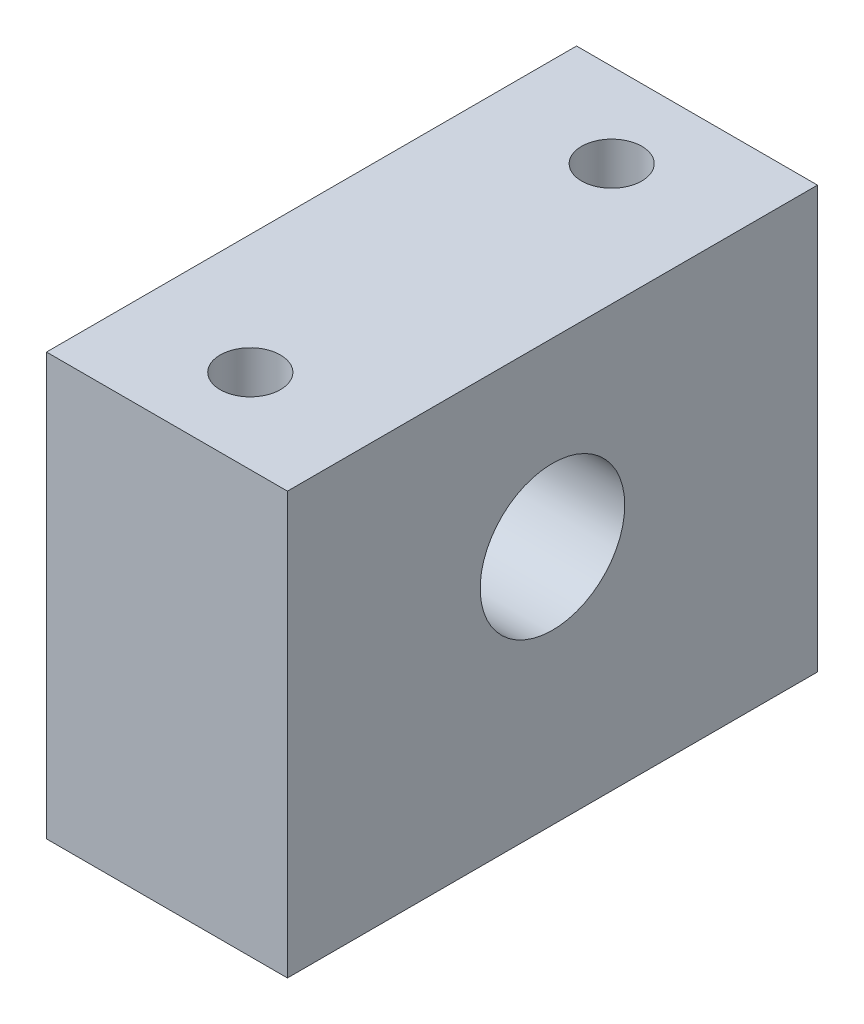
ISO-10303-21;
HEADER;
FILE_DESCRIPTION(('STEP AP214'),'2;1');
FILE_NAME('part.step','',(''),(''),'','','');
FILE_SCHEMA(('AUTOMOTIVE_DESIGN { 1 0 10303 214 1 1 1 1 }'));
ENDSEC;
DATA;
#1=APPLICATION_CONTEXT('core data for automotive mechanical design processes');
#2=APPLICATION_PROTOCOL_DEFINITION('international standard','automotive_design',2000,#1);
#3=PRODUCT_CONTEXT('',#1,'mechanical');
#4=PRODUCT('Part','Part','',(#3));
#5=PRODUCT_RELATED_PRODUCT_CATEGORY('part','',(#4));
#6=PRODUCT_DEFINITION_FORMATION('','',#4);
#7=PRODUCT_DEFINITION_CONTEXT('part definition',#1,'design');
#8=PRODUCT_DEFINITION('design','',#6,#7);
#9=PRODUCT_DEFINITION_SHAPE('','',#8);
#10=(LENGTH_UNIT() NAMED_UNIT(*) SI_UNIT(.MILLI.,.METRE.));
#11=(NAMED_UNIT(*) PLANE_ANGLE_UNIT() SI_UNIT($,.RADIAN.));
#12=(NAMED_UNIT(*) SI_UNIT($,.STERADIAN.) SOLID_ANGLE_UNIT());
#13=UNCERTAINTY_MEASURE_WITH_UNIT(LENGTH_MEASURE(1.E-05),#10,'distance_accuracy_value','');
#14=(GEOMETRIC_REPRESENTATION_CONTEXT(3) GLOBAL_UNCERTAINTY_ASSIGNED_CONTEXT((#13)) GLOBAL_UNIT_ASSIGNED_CONTEXT((#10,
#11,#12)) REPRESENTATION_CONTEXT('',''));
#15=CARTESIAN_POINT('',(0.,0.,0.));
#16=DIRECTION('',(0.,0.,1.));
#17=DIRECTION('',(1.,0.,0.));
#18=AXIS2_PLACEMENT_3D('',#15,#16,#17);
#19=CARTESIAN_POINT('',(-39.472022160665,-3.5749307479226,43.9999999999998));
#20=DIRECTION('',(1.,0.,0.));
#21=DIRECTION('',(0.,1.,0.));
#22=AXIS2_PLACEMENT_3D('',#19,#20,#21);
#23=PLANE('',#22);
#24=CARTESIAN_POINT('',(-39.4720221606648,-18.5749307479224,22.));
#25=DIRECTION('',(1.,0.,0.));
#26=DIRECTION('',(0.,1.,0.));
#27=AXIS2_PLACEMENT_3D('',#24,#25,#26);
#28=CIRCLE('',#27,6.);
#29=CARTESIAN_POINT('',(-39.4720221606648,-12.5749307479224,22.));
#30=VERTEX_POINT('',#29);
#31=EDGE_CURVE('E95',#30,#30,#28,.T.);
#32=ORIENTED_EDGE('',*,*,#31,.T.);
#33=EDGE_LOOP('',(#32));
#34=FACE_BOUND('',#33,.T.);
#35=DIRECTION('',(0.,-1.,0.));
#36=VECTOR('',#35,1.);
#37=CARTESIAN_POINT('',(-39.4720221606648,-3.57493074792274,0.));
#38=LINE('',#37,#36);
#39=CARTESIAN_POINT('',(-39.4720221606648,-3.57493074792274,0.));
#40=VERTEX_POINT('',#39);
#41=CARTESIAN_POINT('',(-39.4720221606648,-38.5749307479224,0.));
#42=VERTEX_POINT('',#41);
#43=EDGE_CURVE('E82',#40,#42,#38,.T.);
#44=ORIENTED_EDGE('',*,*,#43,.T.);
#45=DIRECTION('',(0.,0.,-1.));
#46=VECTOR('',#45,1.);
#47=CARTESIAN_POINT('',(-39.4720221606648,-38.5749307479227,44.));
#48=LINE('',#47,#46);
#49=CARTESIAN_POINT('',(-39.4720221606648,-38.5749307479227,44.));
#50=VERTEX_POINT('',#49);
#51=EDGE_CURVE('E13',#50,#42,#48,.T.);
#52=ORIENTED_EDGE('',*,*,#51,.F.);
#53=DIRECTION('',(0.,-1.,0.));
#54=VECTOR('',#53,1.);
#55=CARTESIAN_POINT('',(-39.472022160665,-3.5749307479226,43.9999999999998));
#56=LINE('',#55,#54);
#57=CARTESIAN_POINT('',(-39.472022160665,-3.5749307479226,43.9999999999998));
#58=VERTEX_POINT('',#57);
#59=EDGE_CURVE('E105',#58,#50,#56,.T.);
#60=ORIENTED_EDGE('',*,*,#59,.F.);
#61=DIRECTION('',(0.,0.,-1.));
#62=VECTOR('',#61,1.);
#63=CARTESIAN_POINT('',(-39.472022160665,-3.5749307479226,43.9999999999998));
#64=LINE('',#63,#62);
#65=EDGE_CURVE('E94',#58,#40,#64,.T.);
#66=ORIENTED_EDGE('',*,*,#65,.T.);
#67=EDGE_LOOP('',(#44,#52,#60,#66));
#68=FACE_BOUND('',#67,.T.);
#69=ADVANCED_FACE('F38',(#34,#68),#23,.F.);
#70=CARTESIAN_POINT('',(-39.4720221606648,-38.5749307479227,44.));
#71=DIRECTION('',(0.,1.,0.));
#72=DIRECTION('',(0.,0.,1.));
#73=AXIS2_PLACEMENT_3D('',#70,#71,#72);
#74=PLANE('',#73);
#75=CARTESIAN_POINT('',(-29.5557462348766,-38.5749307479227,37.));
#76=DIRECTION('',(0.,-1.,0.));
#77=DIRECTION('',(0.,0.,-1.));
#78=AXIS2_PLACEMENT_3D('',#75,#76,#77);
#79=CIRCLE('',#78,2.49999999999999);
#80=CARTESIAN_POINT('',(-29.5557462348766,-38.5749307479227,34.5000000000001));
#81=VERTEX_POINT('',#80);
#82=EDGE_CURVE('E159',#81,#81,#79,.T.);
#83=ORIENTED_EDGE('',*,*,#82,.F.);
#84=EDGE_LOOP('',(#83));
#85=FACE_BOUND('',#84,.T.);
#86=CARTESIAN_POINT('',(-29.5557462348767,-38.5749307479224,6.9999999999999));
#87=DIRECTION('',(0.,-1.,0.));
#88=DIRECTION('',(0.,0.,-1.));
#89=AXIS2_PLACEMENT_3D('',#86,#87,#88);
#90=CIRCLE('',#89,2.49999999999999);
#91=CARTESIAN_POINT('',(-29.5557462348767,-38.5749307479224,4.49999999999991));
#92=VERTEX_POINT('',#91);
#93=EDGE_CURVE('E163',#92,#92,#90,.T.);
#94=ORIENTED_EDGE('',*,*,#93,.F.);
#95=EDGE_LOOP('',(#94));
#96=FACE_BOUND('',#95,.T.);
#97=DIRECTION('',(1.,0.,0.));
#98=VECTOR('',#97,1.);
#99=CARTESIAN_POINT('',(-39.4720221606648,-38.5749307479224,0.));
#100=LINE('',#99,#98);
#101=CARTESIAN_POINT('',(-19.4720221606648,-38.5749307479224,0.));
#102=VERTEX_POINT('',#101);
#103=EDGE_CURVE('E78',#42,#102,#100,.T.);
#104=ORIENTED_EDGE('',*,*,#103,.T.);
#105=DIRECTION('',(0.,0.,-1.));
#106=VECTOR('',#105,1.);
#107=CARTESIAN_POINT('',(-19.4720221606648,-38.5749307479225,43.9999999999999));
#108=LINE('',#107,#106);
#109=CARTESIAN_POINT('',(-19.4720221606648,-38.5749307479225,43.9999999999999));
#110=VERTEX_POINT('',#109);
#111=EDGE_CURVE('E45',#110,#102,#108,.T.);
#112=ORIENTED_EDGE('',*,*,#111,.F.);
#113=DIRECTION('',(1.,0.,0.));
#114=VECTOR('',#113,1.);
#115=CARTESIAN_POINT('',(-39.4720221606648,-38.5749307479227,44.));
#116=LINE('',#115,#114);
#117=EDGE_CURVE('E90',#50,#110,#116,.T.);
#118=ORIENTED_EDGE('',*,*,#117,.F.);
#119=ORIENTED_EDGE('',*,*,#51,.T.);
#120=EDGE_LOOP('',(#104,#112,#118,#119));
#121=FACE_BOUND('',#120,.T.);
#122=ADVANCED_FACE('F89',(#85,#96,#121),#74,.F.);
#123=CARTESIAN_POINT('',(-19.4720221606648,-3.57493074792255,43.9999999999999));
#124=DIRECTION('',(-1.,0.,0.));
#125=DIRECTION('',(0.,0.,1.));
#126=AXIS2_PLACEMENT_3D('',#123,#124,#125);
#127=PLANE('',#126);
#128=CARTESIAN_POINT('',(-19.4720221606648,-18.5749307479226,21.9999999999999));
#129=DIRECTION('',(1.,0.,0.));
#130=DIRECTION('',(0.,0.,-1.));
#131=AXIS2_PLACEMENT_3D('',#128,#129,#130);
#132=CIRCLE('',#131,6.);
#133=CARTESIAN_POINT('',(-19.4720221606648,-18.5749307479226,15.9999999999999));
#134=VERTEX_POINT('',#133);
#135=EDGE_CURVE('E98',#134,#134,#132,.T.);
#136=ORIENTED_EDGE('',*,*,#135,.F.);
#137=EDGE_LOOP('',(#136));
#138=FACE_BOUND('',#137,.T.);
#139=DIRECTION('',(0.,1.,0.));
#140=VECTOR('',#139,1.);
#141=CARTESIAN_POINT('',(-19.4720221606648,-3.57493074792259,-1.11022302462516E-13));
#142=LINE('',#141,#140);
#143=CARTESIAN_POINT('',(-19.4720221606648,-3.57493074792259,-1.11022302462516E-13));
#144=VERTEX_POINT('',#143);
#145=EDGE_CURVE('E83',#102,#144,#142,.T.);
#146=ORIENTED_EDGE('',*,*,#145,.T.);
#147=DIRECTION('',(0.,0.,-1.));
#148=VECTOR('',#147,1.);
#149=CARTESIAN_POINT('',(-19.4720221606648,-3.57493074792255,43.9999999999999));
#150=LINE('',#149,#148);
#151=CARTESIAN_POINT('',(-19.4720221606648,-3.57493074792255,43.9999999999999));
#152=VERTEX_POINT('',#151);
#153=EDGE_CURVE('E111',#152,#144,#150,.T.);
#154=ORIENTED_EDGE('',*,*,#153,.F.);
#155=DIRECTION('',(0.,1.,0.));
#156=VECTOR('',#155,1.);
#157=CARTESIAN_POINT('',(-19.4720221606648,-3.57493074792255,43.9999999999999));
#158=LINE('',#157,#156);
#159=EDGE_CURVE('E57',#110,#152,#158,.T.);
#160=ORIENTED_EDGE('',*,*,#159,.F.);
#161=ORIENTED_EDGE('',*,*,#111,.T.);
#162=EDGE_LOOP('',(#146,#154,#160,#161));
#163=FACE_BOUND('',#162,.T.);
#164=ADVANCED_FACE('F114',(#138,#163),#127,.F.);
#165=CARTESIAN_POINT('',(-39.472022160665,-3.5749307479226,43.9999999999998));
#166=DIRECTION('',(0.,-1.,0.));
#167=DIRECTION('',(0.,0.,-1.));
#168=AXIS2_PLACEMENT_3D('',#165,#166,#167);
#169=PLANE('',#168);
#170=CARTESIAN_POINT('',(-29.5557462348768,-3.57493074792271,37.0000000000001));
#171=DIRECTION('',(0.,-1.,0.));
#172=DIRECTION('',(0.,0.,-1.));
#173=AXIS2_PLACEMENT_3D('',#170,#171,#172);
#174=CIRCLE('',#173,2.49999999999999);
#175=CARTESIAN_POINT('',(-29.5557462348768,-3.57493074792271,34.5000000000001));
#176=VERTEX_POINT('',#175);
#177=EDGE_CURVE('E156',#176,#176,#174,.T.);
#178=ORIENTED_EDGE('',*,*,#177,.T.);
#179=EDGE_LOOP('',(#178));
#180=FACE_BOUND('',#179,.T.);
#181=CARTESIAN_POINT('',(-29.5557462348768,-3.57493074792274,7.00000000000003));
#182=DIRECTION('',(0.,-1.,0.));
#183=DIRECTION('',(0.,0.,-1.));
#184=AXIS2_PLACEMENT_3D('',#181,#182,#183);
#185=CIRCLE('',#184,2.49999999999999);
#186=CARTESIAN_POINT('',(-29.5557462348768,-3.57493074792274,4.50000000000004));
#187=VERTEX_POINT('',#186);
#188=EDGE_CURVE('E160',#187,#187,#185,.T.);
#189=ORIENTED_EDGE('',*,*,#188,.T.);
#190=EDGE_LOOP('',(#189));
#191=FACE_BOUND('',#190,.T.);
#192=DIRECTION('',(-1.,0.,0.));
#193=VECTOR('',#192,1.);
#194=CARTESIAN_POINT('',(-39.4720221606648,-3.57493074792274,0.));
#195=LINE('',#194,#193);
#196=EDGE_CURVE('E103',#144,#40,#195,.T.);
#197=ORIENTED_EDGE('',*,*,#196,.T.);
#198=ORIENTED_EDGE('',*,*,#65,.F.);
#199=DIRECTION('',(-1.,0.,0.));
#200=VECTOR('',#199,1.);
#201=CARTESIAN_POINT('',(-39.472022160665,-3.5749307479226,43.9999999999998));
#202=LINE('',#201,#200);
#203=EDGE_CURVE('E52',#152,#58,#202,.T.);
#204=ORIENTED_EDGE('',*,*,#203,.F.);
#205=ORIENTED_EDGE('',*,*,#153,.T.);
#206=EDGE_LOOP('',(#197,#198,#204,#205));
#207=FACE_BOUND('',#206,.T.);
#208=ADVANCED_FACE('F116',(#180,#191,#207),#169,.F.);
#209=CARTESIAN_POINT('',(-39.4720221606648,-38.5749307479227,44.));
#210=DIRECTION('',(0.,0.,1.));
#211=DIRECTION('',(1.,0.,0.));
#212=AXIS2_PLACEMENT_3D('',#209,#210,#211);
#213=PLANE('',#212);
#214=ORIENTED_EDGE('',*,*,#59,.T.);
#215=ORIENTED_EDGE('',*,*,#117,.T.);
#216=ORIENTED_EDGE('',*,*,#159,.T.);
#217=ORIENTED_EDGE('',*,*,#203,.T.);
#218=EDGE_LOOP('',(#214,#215,#216,#217));
#219=FACE_BOUND('',#218,.T.);
#220=ADVANCED_FACE('F117',(#219),#213,.T.);
#221=CARTESIAN_POINT('',(-39.4720221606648,-38.5749307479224,0.));
#222=DIRECTION('',(0.,0.,1.));
#223=DIRECTION('',(1.,0.,0.));
#224=AXIS2_PLACEMENT_3D('',#221,#222,#223);
#225=PLANE('',#224);
#226=ORIENTED_EDGE('',*,*,#43,.F.);
#227=ORIENTED_EDGE('',*,*,#196,.F.);
#228=ORIENTED_EDGE('',*,*,#145,.F.);
#229=ORIENTED_EDGE('',*,*,#103,.F.);
#230=EDGE_LOOP('',(#226,#227,#228,#229));
#231=FACE_BOUND('',#230,.T.);
#232=ADVANCED_FACE('F79',(#231),#225,.F.);
#233=CARTESIAN_POINT('',(-63.4720221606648,-18.5749307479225,22.));
#234=DIRECTION('',(1.,0.,0.));
#235=DIRECTION('',(0.,0.,-1.));
#236=AXIS2_PLACEMENT_3D('',#233,#234,#235);
#237=CYLINDRICAL_SURFACE('',#236,6.);
#238=ORIENTED_EDGE('',*,*,#135,.T.);
#239=EDGE_LOOP('',(#238));
#240=FACE_BOUND('',#239,.T.);
#241=ORIENTED_EDGE('',*,*,#31,.F.);
#242=EDGE_LOOP('',(#241));
#243=FACE_BOUND('',#242,.T.);
#244=ADVANCED_FACE('F124',(#240,#243),#237,.F.);
#245=CARTESIAN_POINT('',(-29.5557462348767,-38.5749307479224,6.9999999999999));
#246=DIRECTION('',(0.,-1.,0.));
#247=DIRECTION('',(0.,0.,-1.));
#248=AXIS2_PLACEMENT_3D('',#245,#246,#247);
#249=CYLINDRICAL_SURFACE('',#248,2.49999999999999);
#250=ORIENTED_EDGE('',*,*,#188,.F.);
#251=EDGE_LOOP('',(#250));
#252=FACE_BOUND('',#251,.T.);
#253=ORIENTED_EDGE('',*,*,#93,.T.);
#254=EDGE_LOOP('',(#253));
#255=FACE_BOUND('',#254,.T.);
#256=ADVANCED_FACE('F137',(#252,#255),#249,.F.);
#257=CARTESIAN_POINT('',(-29.5557462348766,-38.5749307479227,37.));
#258=DIRECTION('',(0.,-1.,0.));
#259=DIRECTION('',(0.,0.,-1.));
#260=AXIS2_PLACEMENT_3D('',#257,#258,#259);
#261=CYLINDRICAL_SURFACE('',#260,2.49999999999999);
#262=ORIENTED_EDGE('',*,*,#177,.F.);
#263=EDGE_LOOP('',(#262));
#264=FACE_BOUND('',#263,.T.);
#265=ORIENTED_EDGE('',*,*,#82,.T.);
#266=EDGE_LOOP('',(#265));
#267=FACE_BOUND('',#266,.T.);
#268=ADVANCED_FACE('F144',(#264,#267),#261,.F.);
#269=CLOSED_SHELL('',(#69,#122,#164,#208,#220,#232,#244,#256,#268));
#270=MANIFOLD_SOLID_BREP('B2',#269);
#271=ADVANCED_BREP_SHAPE_REPRESENTATION('',(#18,#270),#14);
#272=SHAPE_DEFINITION_REPRESENTATION(#9,#271);
ENDSEC;
END-ISO-10303-21;
